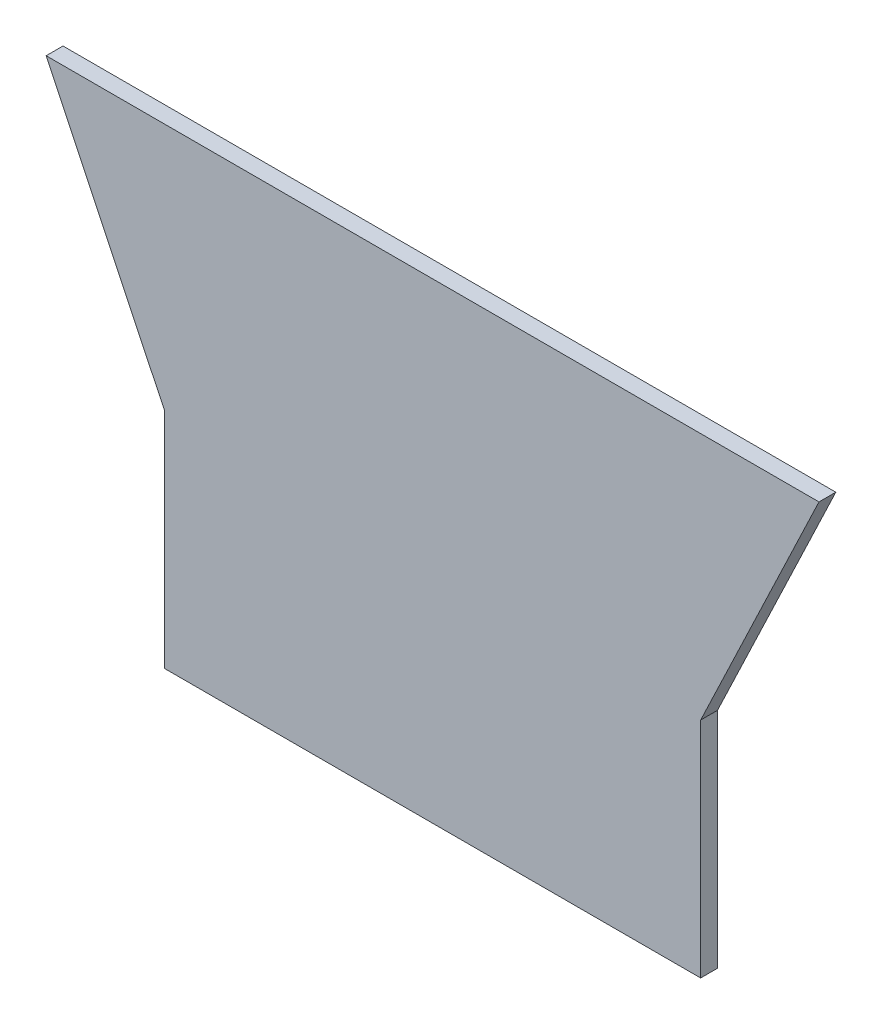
ISO-10303-21;
HEADER;
FILE_DESCRIPTION(('STEP AP214'),'2;1');
FILE_NAME('part.step','',(''),(''),'','','');
FILE_SCHEMA(('AUTOMOTIVE_DESIGN { 1 0 10303 214 1 1 1 1 }'));
ENDSEC;
DATA;
#1=APPLICATION_CONTEXT('core data for automotive mechanical design processes');
#2=APPLICATION_PROTOCOL_DEFINITION('international standard','automotive_design',2000,#1);
#3=PRODUCT_CONTEXT('',#1,'mechanical');
#4=PRODUCT('Part','Part','',(#3));
#5=PRODUCT_RELATED_PRODUCT_CATEGORY('part','',(#4));
#6=PRODUCT_DEFINITION_FORMATION('','',#4);
#7=PRODUCT_DEFINITION_CONTEXT('part definition',#1,'design');
#8=PRODUCT_DEFINITION('design','',#6,#7);
#9=PRODUCT_DEFINITION_SHAPE('','',#8);
#10=(LENGTH_UNIT() NAMED_UNIT(*) SI_UNIT(.MILLI.,.METRE.));
#11=(NAMED_UNIT(*) PLANE_ANGLE_UNIT() SI_UNIT($,.RADIAN.));
#12=(NAMED_UNIT(*) SI_UNIT($,.STERADIAN.) SOLID_ANGLE_UNIT());
#13=UNCERTAINTY_MEASURE_WITH_UNIT(LENGTH_MEASURE(1.E-05),#10,'distance_accuracy_value','');
#14=(GEOMETRIC_REPRESENTATION_CONTEXT(3) GLOBAL_UNCERTAINTY_ASSIGNED_CONTEXT((#13)) GLOBAL_UNIT_ASSIGNED_CONTEXT((#10,
#11,#12)) REPRESENTATION_CONTEXT('',''));
#15=CARTESIAN_POINT('',(0.,0.,0.));
#16=DIRECTION('',(0.,0.,1.));
#17=DIRECTION('',(1.,0.,0.));
#18=AXIS2_PLACEMENT_3D('',#15,#16,#17);
#19=CARTESIAN_POINT('',(72.8590990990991,67.8391666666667,3.175));
#20=DIRECTION('',(0.,-1.,0.));
#21=DIRECTION('',(0.,0.,-1.));
#22=AXIS2_PLACEMENT_3D('',#19,#20,#21);
#23=PLANE('',#22);
#24=DIRECTION('',(-1.,0.,0.));
#25=VECTOR('',#24,1.);
#26=CARTESIAN_POINT('',(72.8590990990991,67.8391666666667,0.));
#27=LINE('',#26,#25);
#28=CARTESIAN_POINT('',(72.8590990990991,67.8391666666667,0.));
#29=VERTEX_POINT('',#28);
#30=CARTESIAN_POINT('',(-72.8590990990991,67.8391666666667,0.));
#31=VERTEX_POINT('',#30);
#32=EDGE_CURVE('E117',#29,#31,#27,.T.);
#33=ORIENTED_EDGE('',*,*,#32,.T.);
#34=DIRECTION('',(0.,0.,-1.));
#35=VECTOR('',#34,1.);
#36=CARTESIAN_POINT('',(-72.8590990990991,67.8391666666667,3.175));
#37=LINE('',#36,#35);
#38=CARTESIAN_POINT('',(-72.8590990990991,67.8391666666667,3.175));
#39=VERTEX_POINT('',#38);
#40=EDGE_CURVE('E11',#39,#31,#37,.T.);
#41=ORIENTED_EDGE('',*,*,#40,.F.);
#42=DIRECTION('',(-1.,0.,0.));
#43=VECTOR('',#42,1.);
#44=CARTESIAN_POINT('',(72.8590990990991,67.8391666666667,3.175));
#45=LINE('',#44,#43);
#46=CARTESIAN_POINT('',(72.8590990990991,67.8391666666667,3.175));
#47=VERTEX_POINT('',#46);
#48=EDGE_CURVE('E127',#47,#39,#45,.T.);
#49=ORIENTED_EDGE('',*,*,#48,.F.);
#50=DIRECTION('',(0.,0.,-1.));
#51=VECTOR('',#50,1.);
#52=CARTESIAN_POINT('',(72.8590990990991,67.8391666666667,3.175));
#53=LINE('',#52,#51);
#54=EDGE_CURVE('E113',#47,#29,#53,.T.);
#55=ORIENTED_EDGE('',*,*,#54,.T.);
#56=EDGE_LOOP('',(#33,#41,#49,#55));
#57=FACE_BOUND('',#56,.T.);
#58=ADVANCED_FACE('F33',(#57),#23,.F.);
#59=CARTESIAN_POINT('',(-72.8590990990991,67.8391666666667,3.175));
#60=DIRECTION('',(0.902577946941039,0.430526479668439,0.));
#61=DIRECTION('',(-0.430526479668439,0.902577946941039,0.));
#62=AXIS2_PLACEMENT_3D('',#59,#60,#61);
#63=PLANE('',#62);
#64=DIRECTION('',(0.430526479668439,-0.902577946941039,0.));
#65=VECTOR('',#64,1.);
#66=CARTESIAN_POINT('',(-72.8590990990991,67.8391666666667,0.));
#67=LINE('',#66,#65);
#68=CARTESIAN_POINT('',(-50.546,21.0608333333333,0.));
#69=VERTEX_POINT('',#68);
#70=EDGE_CURVE('E120',#31,#69,#67,.T.);
#71=ORIENTED_EDGE('',*,*,#70,.T.);
#72=DIRECTION('',(0.,0.,-1.));
#73=VECTOR('',#72,1.);
#74=CARTESIAN_POINT('',(-50.546,21.0608333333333,3.175));
#75=LINE('',#74,#73);
#76=CARTESIAN_POINT('',(-50.546,21.0608333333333,3.175));
#77=VERTEX_POINT('',#76);
#78=EDGE_CURVE('E41',#77,#69,#75,.T.);
#79=ORIENTED_EDGE('',*,*,#78,.F.);
#80=DIRECTION('',(0.430526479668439,-0.902577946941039,0.));
#81=VECTOR('',#80,1.);
#82=CARTESIAN_POINT('',(-72.8590990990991,67.8391666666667,3.175));
#83=LINE('',#82,#81);
#84=EDGE_CURVE('E86',#39,#77,#83,.T.);
#85=ORIENTED_EDGE('',*,*,#84,.F.);
#86=ORIENTED_EDGE('',*,*,#40,.T.);
#87=EDGE_LOOP('',(#71,#79,#85,#86));
#88=FACE_BOUND('',#87,.T.);
#89=ADVANCED_FACE('F151',(#88),#63,.F.);
#90=CARTESIAN_POINT('',(-50.546,21.0608333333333,3.175));
#91=DIRECTION('',(1.,0.,0.));
#92=DIRECTION('',(0.,0.,-1.));
#93=AXIS2_PLACEMENT_3D('',#90,#91,#92);
#94=PLANE('',#93);
#95=DIRECTION('',(0.,-1.,0.));
#96=VECTOR('',#95,1.);
#97=CARTESIAN_POINT('',(-50.546,21.0608333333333,0.));
#98=LINE('',#97,#96);
#99=CARTESIAN_POINT('',(-50.546,-21.0608333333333,0.));
#100=VERTEX_POINT('',#99);
#101=EDGE_CURVE('E122',#69,#100,#98,.T.);
#102=ORIENTED_EDGE('',*,*,#101,.T.);
#103=DIRECTION('',(0.,0.,-1.));
#104=VECTOR('',#103,1.);
#105=CARTESIAN_POINT('',(-50.546,-21.0608333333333,3.175));
#106=LINE('',#105,#104);
#107=CARTESIAN_POINT('',(-50.546,-21.0608333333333,3.175));
#108=VERTEX_POINT('',#107);
#109=EDGE_CURVE('E108',#108,#100,#106,.T.);
#110=ORIENTED_EDGE('',*,*,#109,.F.);
#111=DIRECTION('',(0.,-1.,0.));
#112=VECTOR('',#111,1.);
#113=CARTESIAN_POINT('',(-50.546,21.0608333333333,3.175));
#114=LINE('',#113,#112);
#115=EDGE_CURVE('E99',#77,#108,#114,.T.);
#116=ORIENTED_EDGE('',*,*,#115,.F.);
#117=ORIENTED_EDGE('',*,*,#78,.T.);
#118=EDGE_LOOP('',(#102,#110,#116,#117));
#119=FACE_BOUND('',#118,.T.);
#120=ADVANCED_FACE('F133',(#119),#94,.F.);
#121=CARTESIAN_POINT('',(-50.546,-21.0608333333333,3.175));
#122=DIRECTION('',(0.,1.,0.));
#123=DIRECTION('',(0.,0.,1.));
#124=AXIS2_PLACEMENT_3D('',#121,#122,#123);
#125=PLANE('',#124);
#126=DIRECTION('',(1.,0.,0.));
#127=VECTOR('',#126,1.);
#128=CARTESIAN_POINT('',(-50.546,-21.0608333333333,0.));
#129=LINE('',#128,#127);
#130=CARTESIAN_POINT('',(50.546,-21.0608333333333,0.));
#131=VERTEX_POINT('',#130);
#132=EDGE_CURVE('E107',#100,#131,#129,.T.);
#133=ORIENTED_EDGE('',*,*,#132,.T.);
#134=DIRECTION('',(0.,0.,-1.));
#135=VECTOR('',#134,1.);
#136=CARTESIAN_POINT('',(50.546,-21.0608333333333,3.175));
#137=LINE('',#136,#135);
#138=CARTESIAN_POINT('',(50.546,-21.0608333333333,3.175));
#139=VERTEX_POINT('',#138);
#140=EDGE_CURVE('E104',#139,#131,#137,.T.);
#141=ORIENTED_EDGE('',*,*,#140,.F.);
#142=DIRECTION('',(1.,0.,0.));
#143=VECTOR('',#142,1.);
#144=CARTESIAN_POINT('',(-50.546,-21.0608333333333,3.175));
#145=LINE('',#144,#143);
#146=EDGE_CURVE('E93',#108,#139,#145,.T.);
#147=ORIENTED_EDGE('',*,*,#146,.F.);
#148=ORIENTED_EDGE('',*,*,#109,.T.);
#149=EDGE_LOOP('',(#133,#141,#147,#148));
#150=FACE_BOUND('',#149,.T.);
#151=ADVANCED_FACE('F105',(#150),#125,.F.);
#152=CARTESIAN_POINT('',(50.546,-21.0608333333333,3.175));
#153=DIRECTION('',(-1.,0.,0.));
#154=DIRECTION('',(0.,0.,1.));
#155=AXIS2_PLACEMENT_3D('',#152,#153,#154);
#156=PLANE('',#155);
#157=DIRECTION('',(0.,1.,0.));
#158=VECTOR('',#157,1.);
#159=CARTESIAN_POINT('',(50.546,-21.0608333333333,0.));
#160=LINE('',#159,#158);
#161=CARTESIAN_POINT('',(50.546,21.0608333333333,0.));
#162=VERTEX_POINT('',#161);
#163=EDGE_CURVE('E72',#131,#162,#160,.T.);
#164=ORIENTED_EDGE('',*,*,#163,.T.);
#165=DIRECTION('',(0.,0.,-1.));
#166=VECTOR('',#165,1.);
#167=CARTESIAN_POINT('',(50.546,21.0608333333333,3.175));
#168=LINE('',#167,#166);
#169=CARTESIAN_POINT('',(50.546,21.0608333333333,3.175));
#170=VERTEX_POINT('',#169);
#171=EDGE_CURVE('E109',#170,#162,#168,.T.);
#172=ORIENTED_EDGE('',*,*,#171,.F.);
#173=DIRECTION('',(0.,1.,0.));
#174=VECTOR('',#173,1.);
#175=CARTESIAN_POINT('',(50.546,-21.0608333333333,3.175));
#176=LINE('',#175,#174);
#177=EDGE_CURVE('E97',#139,#170,#176,.T.);
#178=ORIENTED_EDGE('',*,*,#177,.F.);
#179=ORIENTED_EDGE('',*,*,#140,.T.);
#180=EDGE_LOOP('',(#164,#172,#178,#179));
#181=FACE_BOUND('',#180,.T.);
#182=ADVANCED_FACE('F111',(#181),#156,.F.);
#183=CARTESIAN_POINT('',(50.546,21.0608333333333,3.175));
#184=DIRECTION('',(-0.902577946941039,0.430526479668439,0.));
#185=DIRECTION('',(-0.430526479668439,-0.902577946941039,0.));
#186=AXIS2_PLACEMENT_3D('',#183,#184,#185);
#187=PLANE('',#186);
#188=DIRECTION('',(0.430526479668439,0.902577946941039,0.));
#189=VECTOR('',#188,1.);
#190=CARTESIAN_POINT('',(50.546,21.0608333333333,0.));
#191=LINE('',#190,#189);
#192=EDGE_CURVE('E78',#162,#29,#191,.T.);
#193=ORIENTED_EDGE('',*,*,#192,.T.);
#194=ORIENTED_EDGE('',*,*,#54,.F.);
#195=DIRECTION('',(0.430526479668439,0.902577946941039,0.));
#196=VECTOR('',#195,1.);
#197=CARTESIAN_POINT('',(50.546,21.0608333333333,3.175));
#198=LINE('',#197,#196);
#199=EDGE_CURVE('E49',#170,#47,#198,.T.);
#200=ORIENTED_EDGE('',*,*,#199,.F.);
#201=ORIENTED_EDGE('',*,*,#171,.T.);
#202=EDGE_LOOP('',(#193,#194,#200,#201));
#203=FACE_BOUND('',#202,.T.);
#204=ADVANCED_FACE('F140',(#203),#187,.F.);
#205=CARTESIAN_POINT('',(0.,0.,3.175));
#206=DIRECTION('',(0.,0.,1.));
#207=DIRECTION('',(1.,0.,0.));
#208=AXIS2_PLACEMENT_3D('',#205,#206,#207);
#209=PLANE('',#208);
#210=ORIENTED_EDGE('',*,*,#48,.T.);
#211=ORIENTED_EDGE('',*,*,#84,.T.);
#212=ORIENTED_EDGE('',*,*,#115,.T.);
#213=ORIENTED_EDGE('',*,*,#146,.T.);
#214=ORIENTED_EDGE('',*,*,#177,.T.);
#215=ORIENTED_EDGE('',*,*,#199,.T.);
#216=EDGE_LOOP('',(#210,#211,#212,#213,#214,#215));
#217=FACE_BOUND('',#216,.T.);
#218=ADVANCED_FACE('F95',(#217),#209,.T.);
#219=CARTESIAN_POINT('',(0.,0.,0.));
#220=DIRECTION('',(0.,0.,1.));
#221=DIRECTION('',(1.,0.,0.));
#222=AXIS2_PLACEMENT_3D('',#219,#220,#221);
#223=PLANE('',#222);
#224=ORIENTED_EDGE('',*,*,#32,.F.);
#225=ORIENTED_EDGE('',*,*,#192,.F.);
#226=ORIENTED_EDGE('',*,*,#163,.F.);
#227=ORIENTED_EDGE('',*,*,#132,.F.);
#228=ORIENTED_EDGE('',*,*,#101,.F.);
#229=ORIENTED_EDGE('',*,*,#70,.F.);
#230=EDGE_LOOP('',(#224,#225,#226,#227,#228,#229));
#231=FACE_BOUND('',#230,.T.);
#232=ADVANCED_FACE('F136',(#231),#223,.F.);
#233=CLOSED_SHELL('',(#58,#89,#120,#151,#182,#204,#218,#232));
#234=MANIFOLD_SOLID_BREP('B2',#233);
#235=ADVANCED_BREP_SHAPE_REPRESENTATION('',(#18,#234),#14);
#236=SHAPE_DEFINITION_REPRESENTATION(#9,#235);
ENDSEC;
END-ISO-10303-21;
